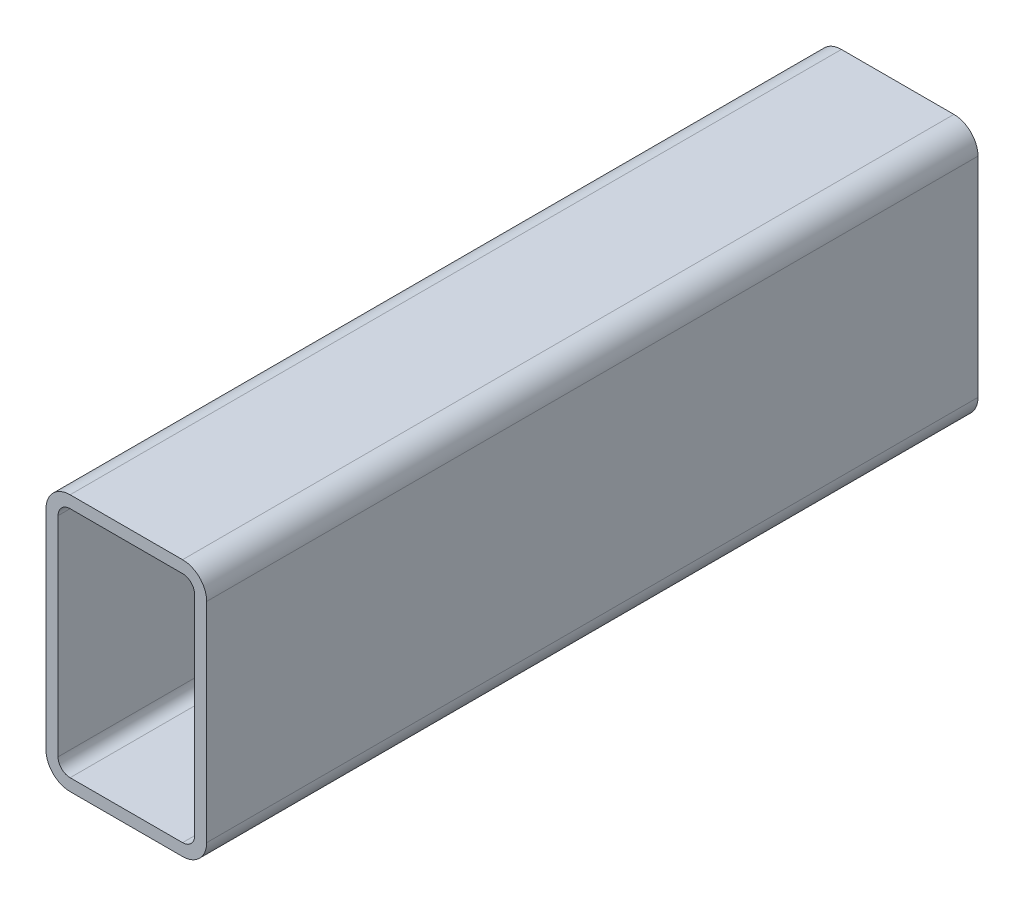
ISO-10303-21;
HEADER;
FILE_DESCRIPTION(('STEP AP214'),'2;1');
FILE_NAME('part.step','',(''),(''),'','','');
FILE_SCHEMA(('AUTOMOTIVE_DESIGN { 1 0 10303 214 1 1 1 1 }'));
ENDSEC;
DATA;
#1=APPLICATION_CONTEXT('core data for automotive mechanical design processes');
#2=APPLICATION_PROTOCOL_DEFINITION('international standard','automotive_design',2000,#1);
#3=PRODUCT_CONTEXT('',#1,'mechanical');
#4=PRODUCT('Part','Part','',(#3));
#5=PRODUCT_RELATED_PRODUCT_CATEGORY('part','',(#4));
#6=PRODUCT_DEFINITION_FORMATION('','',#4);
#7=PRODUCT_DEFINITION_CONTEXT('part definition',#1,'design');
#8=PRODUCT_DEFINITION('design','',#6,#7);
#9=PRODUCT_DEFINITION_SHAPE('','',#8);
#10=(LENGTH_UNIT() NAMED_UNIT(*) SI_UNIT(.MILLI.,.METRE.));
#11=(NAMED_UNIT(*) PLANE_ANGLE_UNIT() SI_UNIT($,.RADIAN.));
#12=(NAMED_UNIT(*) SI_UNIT($,.STERADIAN.) SOLID_ANGLE_UNIT());
#13=UNCERTAINTY_MEASURE_WITH_UNIT(LENGTH_MEASURE(1.E-05),#10,'distance_accuracy_value','');
#14=(GEOMETRIC_REPRESENTATION_CONTEXT(3) GLOBAL_UNCERTAINTY_ASSIGNED_CONTEXT((#13)) GLOBAL_UNIT_ASSIGNED_CONTEXT((#10,
#11,#12)) REPRESENTATION_CONTEXT('',''));
#15=CARTESIAN_POINT('',(0.,0.,0.));
#16=DIRECTION('',(0.,0.,1.));
#17=DIRECTION('',(1.,0.,0.));
#18=AXIS2_PLACEMENT_3D('',#15,#16,#17);
#19=CARTESIAN_POINT('',(12.4210851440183,94.1327651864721,304.8));
#20=DIRECTION('',(0.,0.,1.));
#21=DIRECTION('',(1.,0.,0.));
#22=AXIS2_PLACEMENT_3D('',#19,#20,#21);
#23=PLANE('',#22);
#24=CARTESIAN_POINT('',(12.4210851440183,94.1327651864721,304.8));
#25=DIRECTION('',(0.,0.,1.));
#26=DIRECTION('',(1.,0.,0.));
#27=AXIS2_PLACEMENT_3D('',#24,#25,#26);
#28=CIRCLE('',#27,9.52499999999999);
#29=CARTESIAN_POINT('',(12.4210851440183,103.657765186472,304.8));
#30=VERTEX_POINT('',#29);
#31=CARTESIAN_POINT('',(2.89608514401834,94.1327651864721,304.8));
#32=VERTEX_POINT('',#31);
#33=EDGE_CURVE('E211',#30,#32,#28,.T.);
#34=ORIENTED_EDGE('',*,*,#33,.T.);
#35=DIRECTION('',(0.,-1.,0.));
#36=VECTOR('',#35,1.);
#37=CARTESIAN_POINT('',(2.89608514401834,11.5827651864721,304.8));
#38=LINE('',#37,#36);
#39=CARTESIAN_POINT('',(2.89608514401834,11.5827651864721,304.8));
#40=VERTEX_POINT('',#39);
#41=EDGE_CURVE('E214',#32,#40,#38,.T.);
#42=ORIENTED_EDGE('',*,*,#41,.T.);
#43=CARTESIAN_POINT('',(12.4210851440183,11.5827651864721,304.8));
#44=DIRECTION('',(0.,0.,1.));
#45=DIRECTION('',(1.,0.,0.));
#46=AXIS2_PLACEMENT_3D('',#43,#44,#45);
#47=CIRCLE('',#46,9.52499999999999);
#48=CARTESIAN_POINT('',(12.4210851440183,2.05776518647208,304.8));
#49=VERTEX_POINT('',#48);
#50=EDGE_CURVE('E217',#40,#49,#47,.T.);
#51=ORIENTED_EDGE('',*,*,#50,.T.);
#52=DIRECTION('',(1.,0.,0.));
#53=VECTOR('',#52,1.);
#54=CARTESIAN_POINT('',(56.8710851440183,2.05776518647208,304.8));
#55=LINE('',#54,#53);
#56=CARTESIAN_POINT('',(56.8710851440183,2.05776518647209,304.8));
#57=VERTEX_POINT('',#56);
#58=EDGE_CURVE('E219',#49,#57,#55,.T.);
#59=ORIENTED_EDGE('',*,*,#58,.T.);
#60=CARTESIAN_POINT('',(56.8710851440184,11.5827651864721,304.8));
#61=DIRECTION('',(0.,0.,1.));
#62=DIRECTION('',(1.,0.,0.));
#63=AXIS2_PLACEMENT_3D('',#60,#61,#62);
#64=CIRCLE('',#63,9.52499999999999);
#65=CARTESIAN_POINT('',(66.3960851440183,11.5827651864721,304.8));
#66=VERTEX_POINT('',#65);
#67=EDGE_CURVE('E221',#57,#66,#64,.T.);
#68=ORIENTED_EDGE('',*,*,#67,.T.);
#69=DIRECTION('',(0.,1.,0.));
#70=VECTOR('',#69,1.);
#71=CARTESIAN_POINT('',(66.3960851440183,94.1327651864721,304.8));
#72=LINE('',#71,#70);
#73=CARTESIAN_POINT('',(66.3960851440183,94.1327651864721,304.8));
#74=VERTEX_POINT('',#73);
#75=EDGE_CURVE('E223',#66,#74,#72,.T.);
#76=ORIENTED_EDGE('',*,*,#75,.T.);
#77=CARTESIAN_POINT('',(56.8710851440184,94.1327651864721,304.8));
#78=DIRECTION('',(0.,0.,1.));
#79=DIRECTION('',(1.,0.,0.));
#80=AXIS2_PLACEMENT_3D('',#77,#78,#79);
#81=CIRCLE('',#80,9.52499999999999);
#82=CARTESIAN_POINT('',(56.8710851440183,103.657765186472,304.8));
#83=VERTEX_POINT('',#82);
#84=EDGE_CURVE('E225',#74,#83,#81,.T.);
#85=ORIENTED_EDGE('',*,*,#84,.T.);
#86=DIRECTION('',(-1.,0.,0.));
#87=VECTOR('',#86,1.);
#88=CARTESIAN_POINT('',(12.4210851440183,103.657765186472,304.8));
#89=LINE('',#88,#87);
#90=EDGE_CURVE('E227',#83,#30,#89,.T.);
#91=ORIENTED_EDGE('',*,*,#90,.T.);
#92=EDGE_LOOP('',(#34,#42,#51,#59,#68,#76,#85,#91));
#93=FACE_BOUND('',#92,.T.);
#94=DIRECTION('',(0.,-1.,0.));
#95=VECTOR('',#94,1.);
#96=CARTESIAN_POINT('',(7.65858514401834,11.5827651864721,304.8));
#97=LINE('',#96,#95);
#98=CARTESIAN_POINT('',(7.65858514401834,94.1327651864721,304.8));
#99=VERTEX_POINT('',#98);
#100=CARTESIAN_POINT('',(7.65858514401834,11.5827651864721,304.8));
#101=VERTEX_POINT('',#100);
#102=EDGE_CURVE('E154',#99,#101,#97,.T.);
#103=ORIENTED_EDGE('',*,*,#102,.F.);
#104=CARTESIAN_POINT('',(12.4210851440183,94.1327651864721,304.8));
#105=DIRECTION('',(0.,0.,1.));
#106=DIRECTION('',(1.,0.,0.));
#107=AXIS2_PLACEMENT_3D('',#104,#105,#106);
#108=CIRCLE('',#107,4.76249999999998);
#109=CARTESIAN_POINT('',(12.4210851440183,98.8952651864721,304.8));
#110=VERTEX_POINT('',#109);
#111=EDGE_CURVE('E146',#110,#99,#108,.T.);
#112=ORIENTED_EDGE('',*,*,#111,.F.);
#113=DIRECTION('',(-1.,0.,0.));
#114=VECTOR('',#113,1.);
#115=CARTESIAN_POINT('',(12.4210851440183,98.8952651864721,304.8));
#116=LINE('',#115,#114);
#117=CARTESIAN_POINT('',(56.8710851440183,98.8952651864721,304.8));
#118=VERTEX_POINT('',#117);
#119=EDGE_CURVE('E179',#118,#110,#116,.T.);
#120=ORIENTED_EDGE('',*,*,#119,.F.);
#121=CARTESIAN_POINT('',(56.8710851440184,94.1327651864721,304.8));
#122=DIRECTION('',(0.,0.,1.));
#123=DIRECTION('',(1.,0.,0.));
#124=AXIS2_PLACEMENT_3D('',#121,#122,#123);
#125=CIRCLE('',#124,4.76249999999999);
#126=CARTESIAN_POINT('',(61.6335851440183,94.1327651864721,304.8));
#127=VERTEX_POINT('',#126);
#128=EDGE_CURVE('E177',#127,#118,#125,.T.);
#129=ORIENTED_EDGE('',*,*,#128,.F.);
#130=DIRECTION('',(0.,1.,0.));
#131=VECTOR('',#130,1.);
#132=CARTESIAN_POINT('',(61.6335851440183,94.1327651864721,304.8));
#133=LINE('',#132,#131);
#134=CARTESIAN_POINT('',(61.6335851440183,11.5827651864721,304.8));
#135=VERTEX_POINT('',#134);
#136=EDGE_CURVE('E175',#135,#127,#133,.T.);
#137=ORIENTED_EDGE('',*,*,#136,.F.);
#138=CARTESIAN_POINT('',(56.8710851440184,11.5827651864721,304.8));
#139=DIRECTION('',(0.,0.,1.));
#140=DIRECTION('',(1.,0.,0.));
#141=AXIS2_PLACEMENT_3D('',#138,#139,#140);
#142=CIRCLE('',#141,4.76249999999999);
#143=CARTESIAN_POINT('',(56.8710851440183,6.82026518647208,304.8));
#144=VERTEX_POINT('',#143);
#145=EDGE_CURVE('E173',#144,#135,#142,.T.);
#146=ORIENTED_EDGE('',*,*,#145,.F.);
#147=DIRECTION('',(1.,0.,0.));
#148=VECTOR('',#147,1.);
#149=CARTESIAN_POINT('',(56.8710851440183,6.82026518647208,304.8));
#150=LINE('',#149,#148);
#151=CARTESIAN_POINT('',(12.4210851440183,6.82026518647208,304.8));
#152=VERTEX_POINT('',#151);
#153=EDGE_CURVE('E169',#152,#144,#150,.T.);
#154=ORIENTED_EDGE('',*,*,#153,.F.);
#155=CARTESIAN_POINT('',(12.4210851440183,11.5827651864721,304.8));
#156=DIRECTION('',(0.,0.,1.));
#157=DIRECTION('',(1.,0.,0.));
#158=AXIS2_PLACEMENT_3D('',#155,#156,#157);
#159=CIRCLE('',#158,4.76249999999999);
#160=EDGE_CURVE('E167',#101,#152,#159,.T.);
#161=ORIENTED_EDGE('',*,*,#160,.F.);
#162=EDGE_LOOP('',(#103,#112,#120,#129,#137,#146,#154,#161));
#163=FACE_BOUND('',#162,.T.);
#164=ADVANCED_FACE('F33',(#93,#163),#23,.T.);
#165=CARTESIAN_POINT('',(12.4210851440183,94.1327651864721,0.));
#166=DIRECTION('',(0.,0.,1.));
#167=DIRECTION('',(1.,0.,0.));
#168=AXIS2_PLACEMENT_3D('',#165,#166,#167);
#169=PLANE('',#168);
#170=CARTESIAN_POINT('',(12.4210851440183,94.1327651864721,0.));
#171=DIRECTION('',(0.,0.,1.));
#172=DIRECTION('',(1.,0.,0.));
#173=AXIS2_PLACEMENT_3D('',#170,#171,#172);
#174=CIRCLE('',#173,9.52499999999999);
#175=CARTESIAN_POINT('',(12.4210851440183,103.657765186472,0.));
#176=VERTEX_POINT('',#175);
#177=CARTESIAN_POINT('',(2.89608514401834,94.1327651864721,0.));
#178=VERTEX_POINT('',#177);
#179=EDGE_CURVE('E162',#176,#178,#174,.T.);
#180=ORIENTED_EDGE('',*,*,#179,.F.);
#181=DIRECTION('',(-1.,0.,0.));
#182=VECTOR('',#181,1.);
#183=CARTESIAN_POINT('',(12.4210851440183,103.657765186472,0.));
#184=LINE('',#183,#182);
#185=CARTESIAN_POINT('',(56.8710851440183,103.657765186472,0.));
#186=VERTEX_POINT('',#185);
#187=EDGE_CURVE('E215',#186,#176,#184,.T.);
#188=ORIENTED_EDGE('',*,*,#187,.F.);
#189=CARTESIAN_POINT('',(56.8710851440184,94.1327651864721,0.));
#190=DIRECTION('',(0.,0.,1.));
#191=DIRECTION('',(1.,0.,0.));
#192=AXIS2_PLACEMENT_3D('',#189,#190,#191);
#193=CIRCLE('',#192,9.52499999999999);
#194=CARTESIAN_POINT('',(66.3960851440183,94.1327651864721,0.));
#195=VERTEX_POINT('',#194);
#196=EDGE_CURVE('E242',#195,#186,#193,.T.);
#197=ORIENTED_EDGE('',*,*,#196,.F.);
#198=DIRECTION('',(0.,1.,0.));
#199=VECTOR('',#198,1.);
#200=CARTESIAN_POINT('',(66.3960851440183,94.1327651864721,0.));
#201=LINE('',#200,#199);
#202=CARTESIAN_POINT('',(66.3960851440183,11.5827651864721,0.));
#203=VERTEX_POINT('',#202);
#204=EDGE_CURVE('E240',#203,#195,#201,.T.);
#205=ORIENTED_EDGE('',*,*,#204,.F.);
#206=CARTESIAN_POINT('',(56.8710851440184,11.5827651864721,0.));
#207=DIRECTION('',(0.,0.,1.));
#208=DIRECTION('',(1.,0.,0.));
#209=AXIS2_PLACEMENT_3D('',#206,#207,#208);
#210=CIRCLE('',#209,9.52499999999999);
#211=CARTESIAN_POINT('',(56.8710851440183,2.05776518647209,0.));
#212=VERTEX_POINT('',#211);
#213=EDGE_CURVE('E238',#212,#203,#210,.T.);
#214=ORIENTED_EDGE('',*,*,#213,.F.);
#215=DIRECTION('',(1.,0.,0.));
#216=VECTOR('',#215,1.);
#217=CARTESIAN_POINT('',(56.8710851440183,2.05776518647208,0.));
#218=LINE('',#217,#216);
#219=CARTESIAN_POINT('',(12.4210851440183,2.05776518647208,0.));
#220=VERTEX_POINT('',#219);
#221=EDGE_CURVE('E236',#220,#212,#218,.T.);
#222=ORIENTED_EDGE('',*,*,#221,.F.);
#223=CARTESIAN_POINT('',(12.4210851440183,11.5827651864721,0.));
#224=DIRECTION('',(0.,0.,1.));
#225=DIRECTION('',(1.,0.,0.));
#226=AXIS2_PLACEMENT_3D('',#223,#224,#225);
#227=CIRCLE('',#226,9.52499999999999);
#228=CARTESIAN_POINT('',(2.89608514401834,11.5827651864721,0.));
#229=VERTEX_POINT('',#228);
#230=EDGE_CURVE('E234',#229,#220,#227,.T.);
#231=ORIENTED_EDGE('',*,*,#230,.F.);
#232=DIRECTION('',(0.,-1.,0.));
#233=VECTOR('',#232,1.);
#234=CARTESIAN_POINT('',(2.89608514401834,11.5827651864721,0.));
#235=LINE('',#234,#233);
#236=EDGE_CURVE('E232',#178,#229,#235,.T.);
#237=ORIENTED_EDGE('',*,*,#236,.F.);
#238=EDGE_LOOP('',(#180,#188,#197,#205,#214,#222,#231,#237));
#239=FACE_BOUND('',#238,.T.);
#240=CARTESIAN_POINT('',(12.4210851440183,94.1327651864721,0.));
#241=DIRECTION('',(0.,0.,1.));
#242=DIRECTION('',(1.,0.,0.));
#243=AXIS2_PLACEMENT_3D('',#240,#241,#242);
#244=CIRCLE('',#243,4.76249999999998);
#245=CARTESIAN_POINT('',(12.4210851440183,98.8952651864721,0.));
#246=VERTEX_POINT('',#245);
#247=CARTESIAN_POINT('',(7.65858514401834,94.1327651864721,0.));
#248=VERTEX_POINT('',#247);
#249=EDGE_CURVE('E56',#246,#248,#244,.T.);
#250=ORIENTED_EDGE('',*,*,#249,.T.);
#251=DIRECTION('',(0.,-1.,0.));
#252=VECTOR('',#251,1.);
#253=CARTESIAN_POINT('',(7.65858514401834,11.5827651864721,0.));
#254=LINE('',#253,#252);
#255=CARTESIAN_POINT('',(7.65858514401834,11.5827651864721,0.));
#256=VERTEX_POINT('',#255);
#257=EDGE_CURVE('E161',#248,#256,#254,.T.);
#258=ORIENTED_EDGE('',*,*,#257,.T.);
#259=CARTESIAN_POINT('',(12.4210851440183,11.5827651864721,0.));
#260=DIRECTION('',(0.,0.,1.));
#261=DIRECTION('',(1.,0.,0.));
#262=AXIS2_PLACEMENT_3D('',#259,#260,#261);
#263=CIRCLE('',#262,4.76249999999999);
#264=CARTESIAN_POINT('',(12.4210851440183,6.82026518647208,0.));
#265=VERTEX_POINT('',#264);
#266=EDGE_CURVE('E183',#256,#265,#263,.T.);
#267=ORIENTED_EDGE('',*,*,#266,.T.);
#268=DIRECTION('',(1.,0.,0.));
#269=VECTOR('',#268,1.);
#270=CARTESIAN_POINT('',(56.8710851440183,6.82026518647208,0.));
#271=LINE('',#270,#269);
#272=CARTESIAN_POINT('',(56.8710851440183,6.82026518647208,0.));
#273=VERTEX_POINT('',#272);
#274=EDGE_CURVE('E186',#265,#273,#271,.T.);
#275=ORIENTED_EDGE('',*,*,#274,.T.);
#276=CARTESIAN_POINT('',(56.8710851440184,11.5827651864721,0.));
#277=DIRECTION('',(0.,0.,1.));
#278=DIRECTION('',(1.,0.,0.));
#279=AXIS2_PLACEMENT_3D('',#276,#277,#278);
#280=CIRCLE('',#279,4.76249999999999);
#281=CARTESIAN_POINT('',(61.6335851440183,11.5827651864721,0.));
#282=VERTEX_POINT('',#281);
#283=EDGE_CURVE('E189',#273,#282,#280,.T.);
#284=ORIENTED_EDGE('',*,*,#283,.T.);
#285=DIRECTION('',(0.,1.,0.));
#286=VECTOR('',#285,1.);
#287=CARTESIAN_POINT('',(61.6335851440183,94.1327651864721,0.));
#288=LINE('',#287,#286);
#289=CARTESIAN_POINT('',(61.6335851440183,94.1327651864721,0.));
#290=VERTEX_POINT('',#289);
#291=EDGE_CURVE('E192',#282,#290,#288,.T.);
#292=ORIENTED_EDGE('',*,*,#291,.T.);
#293=CARTESIAN_POINT('',(56.8710851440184,94.1327651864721,0.));
#294=DIRECTION('',(0.,0.,1.));
#295=DIRECTION('',(1.,0.,0.));
#296=AXIS2_PLACEMENT_3D('',#293,#294,#295);
#297=CIRCLE('',#296,4.76249999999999);
#298=CARTESIAN_POINT('',(56.8710851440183,98.8952651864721,0.));
#299=VERTEX_POINT('',#298);
#300=EDGE_CURVE('E195',#290,#299,#297,.T.);
#301=ORIENTED_EDGE('',*,*,#300,.T.);
#302=DIRECTION('',(-1.,0.,0.));
#303=VECTOR('',#302,1.);
#304=CARTESIAN_POINT('',(12.4210851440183,98.8952651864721,0.));
#305=LINE('',#304,#303);
#306=EDGE_CURVE('E155',#299,#246,#305,.T.);
#307=ORIENTED_EDGE('',*,*,#306,.T.);
#308=EDGE_LOOP('',(#250,#258,#267,#275,#284,#292,#301,#307));
#309=FACE_BOUND('',#308,.T.);
#310=ADVANCED_FACE('F272',(#239,#309),#169,.F.);
#311=CARTESIAN_POINT('',(12.4210851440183,94.1327651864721,304.8));
#312=DIRECTION('',(0.,0.,-1.));
#313=DIRECTION('',(-1.,0.,0.));
#314=AXIS2_PLACEMENT_3D('',#311,#312,#313);
#315=CYLINDRICAL_SURFACE('',#314,9.52499999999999);
#316=ORIENTED_EDGE('',*,*,#179,.T.);
#317=DIRECTION('',(0.,0.,-1.));
#318=VECTOR('',#317,1.);
#319=CARTESIAN_POINT('',(2.89608514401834,94.1327651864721,304.8));
#320=LINE('',#319,#318);
#321=EDGE_CURVE('E11',#32,#178,#320,.T.);
#322=ORIENTED_EDGE('',*,*,#321,.F.);
#323=ORIENTED_EDGE('',*,*,#33,.F.);
#324=DIRECTION('',(0.,0.,-1.));
#325=VECTOR('',#324,1.);
#326=CARTESIAN_POINT('',(12.4210851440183,103.657765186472,304.8));
#327=LINE('',#326,#325);
#328=EDGE_CURVE('E229',#30,#176,#327,.T.);
#329=ORIENTED_EDGE('',*,*,#328,.T.);
#330=EDGE_LOOP('',(#316,#322,#323,#329));
#331=FACE_BOUND('',#330,.T.);
#332=ADVANCED_FACE('F35',(#331),#315,.T.);
#333=CARTESIAN_POINT('',(2.89608514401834,11.5827651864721,304.8));
#334=DIRECTION('',(1.,0.,0.));
#335=DIRECTION('',(0.,0.,-1.));
#336=AXIS2_PLACEMENT_3D('',#333,#334,#335);
#337=PLANE('',#336);
#338=ORIENTED_EDGE('',*,*,#236,.T.);
#339=DIRECTION('',(0.,0.,-1.));
#340=VECTOR('',#339,1.);
#341=CARTESIAN_POINT('',(2.89608514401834,11.5827651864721,304.8));
#342=LINE('',#341,#340);
#343=EDGE_CURVE('E41',#40,#229,#342,.T.);
#344=ORIENTED_EDGE('',*,*,#343,.F.);
#345=ORIENTED_EDGE('',*,*,#41,.F.);
#346=ORIENTED_EDGE('',*,*,#321,.T.);
#347=EDGE_LOOP('',(#338,#344,#345,#346));
#348=FACE_BOUND('',#347,.T.);
#349=ADVANCED_FACE('F289',(#348),#337,.F.);
#350=CARTESIAN_POINT('',(12.4210851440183,11.5827651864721,304.8));
#351=DIRECTION('',(0.,0.,-1.));
#352=DIRECTION('',(-1.,0.,0.));
#353=AXIS2_PLACEMENT_3D('',#350,#351,#352);
#354=CYLINDRICAL_SURFACE('',#353,9.52499999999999);
#355=ORIENTED_EDGE('',*,*,#230,.T.);
#356=DIRECTION('',(0.,0.,-1.));
#357=VECTOR('',#356,1.);
#358=CARTESIAN_POINT('',(12.4210851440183,2.05776518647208,304.8));
#359=LINE('',#358,#357);
#360=EDGE_CURVE('E259',#49,#220,#359,.T.);
#361=ORIENTED_EDGE('',*,*,#360,.F.);
#362=ORIENTED_EDGE('',*,*,#50,.F.);
#363=ORIENTED_EDGE('',*,*,#343,.T.);
#364=EDGE_LOOP('',(#355,#361,#362,#363));
#365=FACE_BOUND('',#364,.T.);
#366=ADVANCED_FACE('F266',(#365),#354,.T.);
#367=CARTESIAN_POINT('',(56.8710851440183,2.05776518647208,304.8));
#368=DIRECTION('',(0.,1.,0.));
#369=DIRECTION('',(0.,0.,1.));
#370=AXIS2_PLACEMENT_3D('',#367,#368,#369);
#371=PLANE('',#370);
#372=ORIENTED_EDGE('',*,*,#221,.T.);
#373=DIRECTION('',(0.,0.,-1.));
#374=VECTOR('',#373,1.);
#375=CARTESIAN_POINT('',(56.8710851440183,2.05776518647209,304.8));
#376=LINE('',#375,#374);
#377=EDGE_CURVE('E256',#57,#212,#376,.T.);
#378=ORIENTED_EDGE('',*,*,#377,.F.);
#379=ORIENTED_EDGE('',*,*,#58,.F.);
#380=ORIENTED_EDGE('',*,*,#360,.T.);
#381=EDGE_LOOP('',(#372,#378,#379,#380));
#382=FACE_BOUND('',#381,.T.);
#383=ADVANCED_FACE('F278',(#382),#371,.F.);
#384=CARTESIAN_POINT('',(56.8710851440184,11.5827651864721,304.8));
#385=DIRECTION('',(0.,0.,-1.));
#386=DIRECTION('',(-1.,0.,0.));
#387=AXIS2_PLACEMENT_3D('',#384,#385,#386);
#388=CYLINDRICAL_SURFACE('',#387,9.52499999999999);
#389=ORIENTED_EDGE('',*,*,#213,.T.);
#390=DIRECTION('',(0.,0.,-1.));
#391=VECTOR('',#390,1.);
#392=CARTESIAN_POINT('',(66.3960851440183,11.5827651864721,304.8));
#393=LINE('',#392,#391);
#394=EDGE_CURVE('E253',#66,#203,#393,.T.);
#395=ORIENTED_EDGE('',*,*,#394,.F.);
#396=ORIENTED_EDGE('',*,*,#67,.F.);
#397=ORIENTED_EDGE('',*,*,#377,.T.);
#398=EDGE_LOOP('',(#389,#395,#396,#397));
#399=FACE_BOUND('',#398,.T.);
#400=ADVANCED_FACE('F282',(#399),#388,.T.);
#401=CARTESIAN_POINT('',(66.3960851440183,94.1327651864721,304.8));
#402=DIRECTION('',(-1.,0.,0.));
#403=DIRECTION('',(0.,0.,1.));
#404=AXIS2_PLACEMENT_3D('',#401,#402,#403);
#405=PLANE('',#404);
#406=ORIENTED_EDGE('',*,*,#204,.T.);
#407=DIRECTION('',(0.,0.,-1.));
#408=VECTOR('',#407,1.);
#409=CARTESIAN_POINT('',(66.3960851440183,94.1327651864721,304.8));
#410=LINE('',#409,#408);
#411=EDGE_CURVE('E250',#74,#195,#410,.T.);
#412=ORIENTED_EDGE('',*,*,#411,.F.);
#413=ORIENTED_EDGE('',*,*,#75,.F.);
#414=ORIENTED_EDGE('',*,*,#394,.T.);
#415=EDGE_LOOP('',(#406,#412,#413,#414));
#416=FACE_BOUND('',#415,.T.);
#417=ADVANCED_FACE('F302',(#416),#405,.F.);
#418=CARTESIAN_POINT('',(56.8710851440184,94.1327651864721,304.8));
#419=DIRECTION('',(0.,0.,-1.));
#420=DIRECTION('',(-1.,0.,0.));
#421=AXIS2_PLACEMENT_3D('',#418,#419,#420);
#422=CYLINDRICAL_SURFACE('',#421,9.52499999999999);
#423=ORIENTED_EDGE('',*,*,#196,.T.);
#424=DIRECTION('',(0.,0.,-1.));
#425=VECTOR('',#424,1.);
#426=CARTESIAN_POINT('',(56.8710851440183,103.657765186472,304.8));
#427=LINE('',#426,#425);
#428=EDGE_CURVE('E247',#83,#186,#427,.T.);
#429=ORIENTED_EDGE('',*,*,#428,.F.);
#430=ORIENTED_EDGE('',*,*,#84,.F.);
#431=ORIENTED_EDGE('',*,*,#411,.T.);
#432=EDGE_LOOP('',(#423,#429,#430,#431));
#433=FACE_BOUND('',#432,.T.);
#434=ADVANCED_FACE('F300',(#433),#422,.T.);
#435=CARTESIAN_POINT('',(12.4210851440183,103.657765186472,304.8));
#436=DIRECTION('',(0.,-1.,0.));
#437=DIRECTION('',(0.,0.,-1.));
#438=AXIS2_PLACEMENT_3D('',#435,#436,#437);
#439=PLANE('',#438);
#440=ORIENTED_EDGE('',*,*,#187,.T.);
#441=ORIENTED_EDGE('',*,*,#328,.F.);
#442=ORIENTED_EDGE('',*,*,#90,.F.);
#443=ORIENTED_EDGE('',*,*,#428,.T.);
#444=EDGE_LOOP('',(#440,#441,#442,#443));
#445=FACE_BOUND('',#444,.T.);
#446=ADVANCED_FACE('F295',(#445),#439,.F.);
#447=CARTESIAN_POINT('',(12.4210851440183,94.1327651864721,304.8));
#448=DIRECTION('',(0.,0.,-1.));
#449=DIRECTION('',(-1.,0.,0.));
#450=AXIS2_PLACEMENT_3D('',#447,#448,#449);
#451=CYLINDRICAL_SURFACE('',#450,4.76249999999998);
#452=ORIENTED_EDGE('',*,*,#249,.F.);
#453=DIRECTION('',(0.,0.,-1.));
#454=VECTOR('',#453,1.);
#455=CARTESIAN_POINT('',(12.4210851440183,98.8952651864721,304.8));
#456=LINE('',#455,#454);
#457=EDGE_CURVE('E150',#110,#246,#456,.T.);
#458=ORIENTED_EDGE('',*,*,#457,.F.);
#459=ORIENTED_EDGE('',*,*,#111,.T.);
#460=DIRECTION('',(0.,0.,-1.));
#461=VECTOR('',#460,1.);
#462=CARTESIAN_POINT('',(7.65858514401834,94.1327651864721,304.8));
#463=LINE('',#462,#461);
#464=EDGE_CURVE('E149',#99,#248,#463,.T.);
#465=ORIENTED_EDGE('',*,*,#464,.T.);
#466=EDGE_LOOP('',(#452,#458,#459,#465));
#467=FACE_BOUND('',#466,.T.);
#468=ADVANCED_FACE('F148',(#467),#451,.F.);
#469=CARTESIAN_POINT('',(7.65858514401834,11.5827651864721,304.8));
#470=DIRECTION('',(1.,0.,0.));
#471=DIRECTION('',(0.,0.,-1.));
#472=AXIS2_PLACEMENT_3D('',#469,#470,#471);
#473=PLANE('',#472);
#474=ORIENTED_EDGE('',*,*,#257,.F.);
#475=ORIENTED_EDGE('',*,*,#464,.F.);
#476=ORIENTED_EDGE('',*,*,#102,.T.);
#477=DIRECTION('',(0.,0.,-1.));
#478=VECTOR('',#477,1.);
#479=CARTESIAN_POINT('',(7.65858514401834,11.5827651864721,304.8));
#480=LINE('',#479,#478);
#481=EDGE_CURVE('E163',#101,#256,#480,.T.);
#482=ORIENTED_EDGE('',*,*,#481,.T.);
#483=EDGE_LOOP('',(#474,#475,#476,#482));
#484=FACE_BOUND('',#483,.T.);
#485=ADVANCED_FACE('F158',(#484),#473,.T.);
#486=CARTESIAN_POINT('',(12.4210851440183,11.5827651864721,304.8));
#487=DIRECTION('',(0.,0.,-1.));
#488=DIRECTION('',(-1.,0.,0.));
#489=AXIS2_PLACEMENT_3D('',#486,#487,#488);
#490=CYLINDRICAL_SURFACE('',#489,4.76249999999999);
#491=ORIENTED_EDGE('',*,*,#266,.F.);
#492=ORIENTED_EDGE('',*,*,#481,.F.);
#493=ORIENTED_EDGE('',*,*,#160,.T.);
#494=DIRECTION('',(0.,0.,-1.));
#495=VECTOR('',#494,1.);
#496=CARTESIAN_POINT('',(12.4210851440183,6.82026518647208,304.8));
#497=LINE('',#496,#495);
#498=EDGE_CURVE('E208',#152,#265,#497,.T.);
#499=ORIENTED_EDGE('',*,*,#498,.T.);
#500=EDGE_LOOP('',(#491,#492,#493,#499));
#501=FACE_BOUND('',#500,.T.);
#502=ADVANCED_FACE('F327',(#501),#490,.F.);
#503=CARTESIAN_POINT('',(56.8710851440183,6.82026518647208,304.8));
#504=DIRECTION('',(0.,1.,0.));
#505=DIRECTION('',(0.,0.,1.));
#506=AXIS2_PLACEMENT_3D('',#503,#504,#505);
#507=PLANE('',#506);
#508=ORIENTED_EDGE('',*,*,#274,.F.);
#509=ORIENTED_EDGE('',*,*,#498,.F.);
#510=ORIENTED_EDGE('',*,*,#153,.T.);
#511=DIRECTION('',(0.,0.,-1.));
#512=VECTOR('',#511,1.);
#513=CARTESIAN_POINT('',(56.8710851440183,6.82026518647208,304.8));
#514=LINE('',#513,#512);
#515=EDGE_CURVE('E206',#144,#273,#514,.T.);
#516=ORIENTED_EDGE('',*,*,#515,.T.);
#517=EDGE_LOOP('',(#508,#509,#510,#516));
#518=FACE_BOUND('',#517,.T.);
#519=ADVANCED_FACE('F331',(#518),#507,.T.);
#520=CARTESIAN_POINT('',(56.8710851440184,11.5827651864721,304.8));
#521=DIRECTION('',(0.,0.,-1.));
#522=DIRECTION('',(-1.,0.,0.));
#523=AXIS2_PLACEMENT_3D('',#520,#521,#522);
#524=CYLINDRICAL_SURFACE('',#523,4.76249999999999);
#525=ORIENTED_EDGE('',*,*,#283,.F.);
#526=ORIENTED_EDGE('',*,*,#515,.F.);
#527=ORIENTED_EDGE('',*,*,#145,.T.);
#528=DIRECTION('',(0.,0.,-1.));
#529=VECTOR('',#528,1.);
#530=CARTESIAN_POINT('',(61.6335851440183,11.5827651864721,304.8));
#531=LINE('',#530,#529);
#532=EDGE_CURVE('E204',#135,#282,#531,.T.);
#533=ORIENTED_EDGE('',*,*,#532,.T.);
#534=EDGE_LOOP('',(#525,#526,#527,#533));
#535=FACE_BOUND('',#534,.T.);
#536=ADVANCED_FACE('F337',(#535),#524,.F.);
#537=CARTESIAN_POINT('',(61.6335851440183,94.1327651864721,304.8));
#538=DIRECTION('',(-1.,0.,0.));
#539=DIRECTION('',(0.,0.,1.));
#540=AXIS2_PLACEMENT_3D('',#537,#538,#539);
#541=PLANE('',#540);
#542=ORIENTED_EDGE('',*,*,#291,.F.);
#543=ORIENTED_EDGE('',*,*,#532,.F.);
#544=ORIENTED_EDGE('',*,*,#136,.T.);
#545=DIRECTION('',(0.,0.,-1.));
#546=VECTOR('',#545,1.);
#547=CARTESIAN_POINT('',(61.6335851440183,94.1327651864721,304.8));
#548=LINE('',#547,#546);
#549=EDGE_CURVE('E202',#127,#290,#548,.T.);
#550=ORIENTED_EDGE('',*,*,#549,.T.);
#551=EDGE_LOOP('',(#542,#543,#544,#550));
#552=FACE_BOUND('',#551,.T.);
#553=ADVANCED_FACE('F341',(#552),#541,.T.);
#554=CARTESIAN_POINT('',(56.8710851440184,94.1327651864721,304.8));
#555=DIRECTION('',(0.,0.,-1.));
#556=DIRECTION('',(-1.,0.,0.));
#557=AXIS2_PLACEMENT_3D('',#554,#555,#556);
#558=CYLINDRICAL_SURFACE('',#557,4.76249999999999);
#559=ORIENTED_EDGE('',*,*,#300,.F.);
#560=ORIENTED_EDGE('',*,*,#549,.F.);
#561=ORIENTED_EDGE('',*,*,#128,.T.);
#562=DIRECTION('',(0.,0.,-1.));
#563=VECTOR('',#562,1.);
#564=CARTESIAN_POINT('',(56.8710851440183,98.8952651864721,304.8));
#565=LINE('',#564,#563);
#566=EDGE_CURVE('E48',#118,#299,#565,.T.);
#567=ORIENTED_EDGE('',*,*,#566,.T.);
#568=EDGE_LOOP('',(#559,#560,#561,#567));
#569=FACE_BOUND('',#568,.T.);
#570=ADVANCED_FACE('F345',(#569),#558,.F.);
#571=CARTESIAN_POINT('',(12.4210851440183,98.8952651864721,304.8));
#572=DIRECTION('',(0.,-1.,0.));
#573=DIRECTION('',(0.,0.,-1.));
#574=AXIS2_PLACEMENT_3D('',#571,#572,#573);
#575=PLANE('',#574);
#576=ORIENTED_EDGE('',*,*,#306,.F.);
#577=ORIENTED_EDGE('',*,*,#566,.F.);
#578=ORIENTED_EDGE('',*,*,#119,.T.);
#579=ORIENTED_EDGE('',*,*,#457,.T.);
#580=EDGE_LOOP('',(#576,#577,#578,#579));
#581=FACE_BOUND('',#580,.T.);
#582=ADVANCED_FACE('F349',(#581),#575,.T.);
#583=CLOSED_SHELL('',(#164,#310,#332,#349,#366,#383,#400,#417,#434,#446,#468,#485,#502,#519,
#536,#553,#570,#582));
#584=MANIFOLD_SOLID_BREP('B2',#583);
#585=ADVANCED_BREP_SHAPE_REPRESENTATION('',(#18,#584),#14);
#586=SHAPE_DEFINITION_REPRESENTATION(#9,#585);
ENDSEC;
END-ISO-10303-21;
